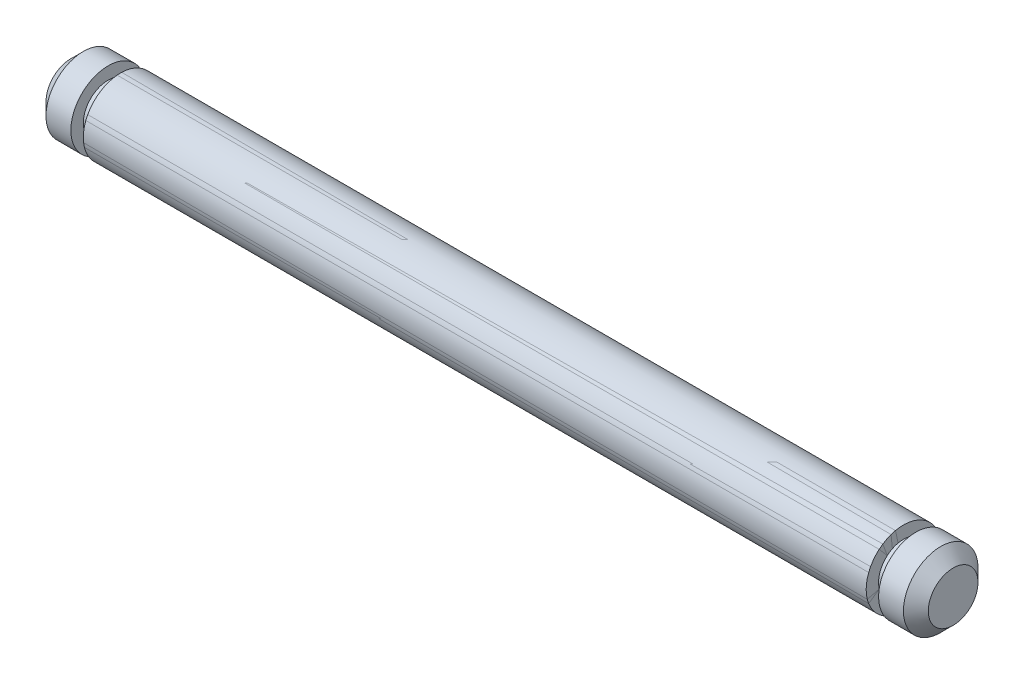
ISO-10303-21;
HEADER;
FILE_DESCRIPTION(('STEP AP214'),'2;1');
FILE_NAME('part.step','',(''),(''),'','','');
FILE_SCHEMA(('AUTOMOTIVE_DESIGN { 1 0 10303 214 1 1 1 1 }'));
ENDSEC;
DATA;
#1=APPLICATION_CONTEXT('core data for automotive mechanical design processes');
#2=APPLICATION_PROTOCOL_DEFINITION('international standard','automotive_design',2000,#1);
#3=PRODUCT_CONTEXT('',#1,'mechanical');
#4=PRODUCT('Part','Part','',(#3));
#5=PRODUCT_RELATED_PRODUCT_CATEGORY('part','',(#4));
#6=PRODUCT_DEFINITION_FORMATION('','',#4);
#7=PRODUCT_DEFINITION_CONTEXT('part definition',#1,'design');
#8=PRODUCT_DEFINITION('design','',#6,#7);
#9=PRODUCT_DEFINITION_SHAPE('','',#8);
#10=(LENGTH_UNIT() NAMED_UNIT(*) SI_UNIT(.MILLI.,.METRE.));
#11=(NAMED_UNIT(*) PLANE_ANGLE_UNIT() SI_UNIT($,.RADIAN.));
#12=(NAMED_UNIT(*) SI_UNIT($,.STERADIAN.) SOLID_ANGLE_UNIT());
#13=UNCERTAINTY_MEASURE_WITH_UNIT(LENGTH_MEASURE(1.E-05),#10,'distance_accuracy_value','');
#14=(GEOMETRIC_REPRESENTATION_CONTEXT(3) GLOBAL_UNCERTAINTY_ASSIGNED_CONTEXT((#13)) GLOBAL_UNIT_ASSIGNED_CONTEXT((#10,
#11,#12)) REPRESENTATION_CONTEXT('',''));
#15=CARTESIAN_POINT('',(0.,0.,0.));
#16=DIRECTION('',(0.,0.,1.));
#17=DIRECTION('',(1.,0.,0.));
#18=AXIS2_PLACEMENT_3D('',#15,#16,#17);
#19=CARTESIAN_POINT('',(-57.75,-1.3968022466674,0.22123174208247));
#20=DIRECTION('',(-1.,0.,0.));
#21=DIRECTION('',(0.,0.809016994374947,0.587785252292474));
#22=AXIS2_PLACEMENT_3D('',#19,#20,#21);
#23=PLANE('',#22);
#24=CARTESIAN_POINT('',(-57.75,0.,0.));
#25=DIRECTION('',(1.,0.,0.));
#26=DIRECTION('',(0.,0.,-1.));
#27=AXIS2_PLACEMENT_3D('',#24,#25,#26);
#28=CIRCLE('',#27,0.999999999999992);
#29=CARTESIAN_POINT('',(-57.75,0.,-0.999999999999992));
#30=VERTEX_POINT('',#29);
#31=EDGE_CURVE('P0_E406',#30,#30,#28,.F.);
#32=ORIENTED_EDGE('',*,*,#31,.T.);
#33=EDGE_LOOP('',(#32));
#34=FACE_BOUND('',#33,.T.);
#35=ADVANCED_FACE('P0_F348',(#34),#23,.T.);
#36=CARTESIAN_POINT('',(-57.25,0.,0.));
#37=DIRECTION('',(1.,0.,0.));
#38=DIRECTION('',(0.,0.,-1.));
#39=AXIS2_PLACEMENT_3D('',#36,#37,#38);
#40=CONICAL_SURFACE('',#39,1.49999999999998,0.785398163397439);
#41=ORIENTED_EDGE('',*,*,#31,.F.);
#42=EDGE_LOOP('',(#41));
#43=FACE_BOUND('',#42,.T.);
#44=CARTESIAN_POINT('',(-57.25,0.,0.));
#45=DIRECTION('',(-1.,0.,0.));
#46=DIRECTION('',(0.,0.809016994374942,0.58778525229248));
#47=AXIS2_PLACEMENT_3D('',#44,#45,#46);
#48=CIRCLE('',#47,1.49999999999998);
#49=CARTESIAN_POINT('',(-57.25,1.2135254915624,0.88167787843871));
#50=VERTEX_POINT('',#49);
#51=EDGE_CURVE('P0_E404',#50,#50,#48,.T.);
#52=ORIENTED_EDGE('',*,*,#51,.T.);
#53=EDGE_LOOP('',(#52));
#54=FACE_BOUND('',#53,.T.);
#55=ADVANCED_FACE('P0_F442',(#43,#54),#40,.T.);
#56=CARTESIAN_POINT('',(-56.25,0.,0.));
#57=DIRECTION('',(-1.,0.,0.));
#58=DIRECTION('',(0.,0.,1.));
#59=AXIS2_PLACEMENT_3D('',#56,#57,#58);
#60=CYLINDRICAL_SURFACE('',#59,1.49999999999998);
#61=ORIENTED_EDGE('',*,*,#51,.F.);
#62=EDGE_LOOP('',(#61));
#63=FACE_BOUND('',#62,.T.);
#64=CARTESIAN_POINT('',(-56.25,0.,0.));
#65=DIRECTION('',(-1.,0.,0.));
#66=DIRECTION('',(0.,0.,1.));
#67=AXIS2_PLACEMENT_3D('',#64,#65,#66);
#68=CIRCLE('',#67,1.49999999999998);
#69=CARTESIAN_POINT('',(-56.25,0.,1.49999999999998));
#70=VERTEX_POINT('',#69);
#71=EDGE_CURVE('P0_E399',#70,#70,#68,.F.);
#72=ORIENTED_EDGE('',*,*,#71,.F.);
#73=EDGE_LOOP('',(#72));
#74=FACE_BOUND('',#73,.T.);
#75=ADVANCED_FACE('P0_F447',(#63,#74),#60,.T.);
#76=CARTESIAN_POINT('',(-56.25,-0.33184761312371,-2.0952033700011));
#77=DIRECTION('',(1.,0.,0.));
#78=DIRECTION('',(0.,0.809016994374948,0.587785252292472));
#79=AXIS2_PLACEMENT_3D('',#76,#77,#78);
#80=PLANE('',#79);
#81=CARTESIAN_POINT('',(-56.25,0.,0.));
#82=DIRECTION('',(-1.,0.,0.));
#83=DIRECTION('',(0.,0.,1.));
#84=AXIS2_PLACEMENT_3D('',#81,#82,#83);
#85=CIRCLE('',#84,0.999999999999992);
#86=CARTESIAN_POINT('',(-56.25,0.,0.999999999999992));
#87=VERTEX_POINT('',#86);
#88=EDGE_CURVE('P0_E394',#87,#87,#85,.T.);
#89=ORIENTED_EDGE('',*,*,#88,.T.);
#90=EDGE_LOOP('',(#89));
#91=FACE_BOUND('',#90,.T.);
#92=ORIENTED_EDGE('',*,*,#71,.T.);
#93=EDGE_LOOP('',(#92));
#94=FACE_BOUND('',#93,.T.);
#95=ADVANCED_FACE('P0_F443',(#91,#94),#80,.T.);
#96=CARTESIAN_POINT('',(-55.75,0.,0.));
#97=DIRECTION('',(-1.,0.,0.));
#98=DIRECTION('',(0.,0.,1.));
#99=AXIS2_PLACEMENT_3D('',#96,#97,#98);
#100=CYLINDRICAL_SURFACE('',#99,0.999999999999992);
#101=ORIENTED_EDGE('',*,*,#88,.F.);
#102=EDGE_LOOP('',(#101));
#103=FACE_BOUND('',#102,.T.);
#104=CARTESIAN_POINT('',(-55.75,0.,0.));
#105=DIRECTION('',(-1.,0.,0.));
#106=DIRECTION('',(0.,0.,1.));
#107=AXIS2_PLACEMENT_3D('',#104,#105,#106);
#108=CIRCLE('',#107,0.999999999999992);
#109=CARTESIAN_POINT('',(-55.75,0.,0.999999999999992));
#110=VERTEX_POINT('',#109);
#111=EDGE_CURVE('P0_E389',#110,#110,#108,.F.);
#112=ORIENTED_EDGE('',*,*,#111,.F.);
#113=EDGE_LOOP('',(#112));
#114=FACE_BOUND('',#113,.T.);
#115=ADVANCED_FACE('P0_F446',(#103,#114),#100,.T.);
#116=CARTESIAN_POINT('',(-55.75,-2.0952033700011,0.33184761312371));
#117=DIRECTION('',(-1.,0.,0.));
#118=DIRECTION('',(0.,0.809016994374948,0.587785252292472));
#119=AXIS2_PLACEMENT_3D('',#116,#117,#118);
#120=PLANE('',#119);
#121=ORIENTED_EDGE('',*,*,#111,.T.);
#122=EDGE_LOOP('',(#121));
#123=FACE_BOUND('',#122,.T.);
#124=CARTESIAN_POINT('',(-55.75,0.,0.));
#125=DIRECTION('',(-1.,0.,0.));
#126=DIRECTION('',(0.,0.,1.));
#127=AXIS2_PLACEMENT_3D('',#124,#125,#126);
#128=CIRCLE('',#127,1.49999999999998);
#129=CARTESIAN_POINT('',(-55.75,0.,1.49999999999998));
#130=VERTEX_POINT('',#129);
#131=EDGE_CURVE('P0_E384',#130,#130,#128,.T.);
#132=ORIENTED_EDGE('',*,*,#131,.T.);
#133=EDGE_LOOP('',(#132));
#134=FACE_BOUND('',#133,.T.);
#135=ADVANCED_FACE('P0_F449',(#123,#134),#120,.T.);
#136=CARTESIAN_POINT('',(-22.25,-0.22123174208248,-1.3968022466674));
#137=DIRECTION('',(1.,0.,0.));
#138=DIRECTION('',(0.,0.809016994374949,0.587785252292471));
#139=AXIS2_PLACEMENT_3D('',#136,#137,#138);
#140=PLANE('',#139);
#141=CARTESIAN_POINT('',(-22.25,0.,0.));
#142=DIRECTION('',(-1.,0.,0.));
#143=DIRECTION('',(0.,0.,1.));
#144=AXIS2_PLACEMENT_3D('',#141,#142,#143);
#145=CIRCLE('',#144,0.999999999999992);
#146=CARTESIAN_POINT('',(-22.25,0.,0.999999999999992));
#147=VERTEX_POINT('',#146);
#148=EDGE_CURVE('P0_E379',#147,#147,#145,.F.);
#149=ORIENTED_EDGE('',*,*,#148,.T.);
#150=EDGE_LOOP('',(#149));
#151=FACE_BOUND('',#150,.T.);
#152=ADVANCED_FACE('P0_F452',(#151),#140,.T.);
#153=CARTESIAN_POINT('',(-24.25,0.,0.));
#154=DIRECTION('',(-1.,0.,0.));
#155=DIRECTION('',(0.,0.,1.));
#156=AXIS2_PLACEMENT_3D('',#153,#154,#155);
#157=CYLINDRICAL_SURFACE('',#156,1.49999999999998);
#158=ORIENTED_EDGE('',*,*,#131,.F.);
#159=EDGE_LOOP('',(#158));
#160=FACE_BOUND('',#159,.T.);
#161=CARTESIAN_POINT('',(-24.25,0.,0.));
#162=DIRECTION('',(-1.,0.,0.));
#163=DIRECTION('',(0.,0.,1.));
#164=AXIS2_PLACEMENT_3D('',#161,#162,#163);
#165=CIRCLE('',#164,1.49999999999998);
#166=CARTESIAN_POINT('',(-24.25,0.,1.49999999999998));
#167=VERTEX_POINT('',#166);
#168=EDGE_CURVE('P0_E376',#167,#167,#165,.F.);
#169=ORIENTED_EDGE('',*,*,#168,.F.);
#170=EDGE_LOOP('',(#169));
#171=FACE_BOUND('',#170,.T.);
#172=ADVANCED_FACE('P0_F455',(#160,#171),#157,.T.);
#173=CARTESIAN_POINT('',(-22.25,0.,0.));
#174=DIRECTION('',(-1.,0.,0.));
#175=DIRECTION('',(0.,0.,1.));
#176=AXIS2_PLACEMENT_3D('',#173,#174,#175);
#177=CONICAL_SURFACE('',#176,0.999999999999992,0.785398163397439);
#178=ORIENTED_EDGE('',*,*,#148,.F.);
#179=EDGE_LOOP('',(#178));
#180=FACE_BOUND('',#179,.T.);
#181=CARTESIAN_POINT('',(-22.75,0.,0.));
#182=DIRECTION('',(-1.,0.,0.));
#183=DIRECTION('',(0.,0.809016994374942,0.58778525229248));
#184=AXIS2_PLACEMENT_3D('',#181,#182,#183);
#185=CIRCLE('',#184,1.49999999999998);
#186=CARTESIAN_POINT('',(-22.75,1.2135254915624,0.88167787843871));
#187=VERTEX_POINT('',#186);
#188=EDGE_CURVE('P0_E373',#187,#187,#185,.F.);
#189=ORIENTED_EDGE('',*,*,#188,.T.);
#190=EDGE_LOOP('',(#189));
#191=FACE_BOUND('',#190,.T.);
#192=ADVANCED_FACE('P0_F419',(#180,#191),#177,.T.);
#193=CARTESIAN_POINT('',(-24.25,-0.33184761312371,-2.0952033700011));
#194=DIRECTION('',(1.,0.,0.));
#195=DIRECTION('',(0.,0.809016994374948,0.587785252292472));
#196=AXIS2_PLACEMENT_3D('',#193,#194,#195);
#197=PLANE('',#196);
#198=CARTESIAN_POINT('',(-24.25,0.,0.));
#199=DIRECTION('',(-1.,0.,0.));
#200=DIRECTION('',(0.,0.,1.));
#201=AXIS2_PLACEMENT_3D('',#198,#199,#200);
#202=CIRCLE('',#201,0.999999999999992);
#203=CARTESIAN_POINT('',(-24.25,0.,0.999999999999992));
#204=VERTEX_POINT('',#203);
#205=EDGE_CURVE('P0_E361',#204,#204,#202,.T.);
#206=ORIENTED_EDGE('',*,*,#205,.T.);
#207=EDGE_LOOP('',(#206));
#208=FACE_BOUND('',#207,.T.);
#209=ORIENTED_EDGE('',*,*,#168,.T.);
#210=EDGE_LOOP('',(#209));
#211=FACE_BOUND('',#210,.T.);
#212=ADVANCED_FACE('P0_F425',(#208,#211),#197,.T.);
#213=CARTESIAN_POINT('',(-22.75,0.,0.));
#214=DIRECTION('',(-1.,0.,0.));
#215=DIRECTION('',(0.,0.,1.));
#216=AXIS2_PLACEMENT_3D('',#213,#214,#215);
#217=CYLINDRICAL_SURFACE('',#216,1.49999999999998);
#218=ORIENTED_EDGE('',*,*,#188,.F.);
#219=EDGE_LOOP('',(#218));
#220=FACE_BOUND('',#219,.T.);
#221=CARTESIAN_POINT('',(-23.75,0.,0.));
#222=DIRECTION('',(-1.,0.,0.));
#223=DIRECTION('',(0.,0.,1.));
#224=AXIS2_PLACEMENT_3D('',#221,#222,#223);
#225=CIRCLE('',#224,1.49999999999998);
#226=CARTESIAN_POINT('',(-23.75,0.,1.49999999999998));
#227=VERTEX_POINT('',#226);
#228=EDGE_CURVE('P0_E356',#227,#227,#225,.T.);
#229=ORIENTED_EDGE('',*,*,#228,.F.);
#230=EDGE_LOOP('',(#229));
#231=FACE_BOUND('',#230,.T.);
#232=ADVANCED_FACE('P0_F421',(#220,#231),#217,.T.);
#233=CARTESIAN_POINT('',(-23.75,0.,0.));
#234=DIRECTION('',(-1.,0.,0.));
#235=DIRECTION('',(0.,0.,1.));
#236=AXIS2_PLACEMENT_3D('',#233,#234,#235);
#237=CYLINDRICAL_SURFACE('',#236,0.999999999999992);
#238=CARTESIAN_POINT('',(-23.75,0.,0.));
#239=DIRECTION('',(-1.,0.,0.));
#240=DIRECTION('',(0.,0.,1.));
#241=AXIS2_PLACEMENT_3D('',#238,#239,#240);
#242=CIRCLE('',#241,0.999999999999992);
#243=CARTESIAN_POINT('',(-23.75,0.,0.999999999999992));
#244=VERTEX_POINT('',#243);
#245=EDGE_CURVE('P0_E10',#244,#244,#242,.F.);
#246=ORIENTED_EDGE('',*,*,#245,.F.);
#247=EDGE_LOOP('',(#246));
#248=FACE_BOUND('',#247,.T.);
#249=ORIENTED_EDGE('',*,*,#205,.F.);
#250=EDGE_LOOP('',(#249));
#251=FACE_BOUND('',#250,.T.);
#252=ADVANCED_FACE('P0_F424',(#248,#251),#237,.T.);
#253=CARTESIAN_POINT('',(-23.75,-2.0952033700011,0.33184761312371));
#254=DIRECTION('',(-1.,0.,0.));
#255=DIRECTION('',(0.,0.809016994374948,0.587785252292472));
#256=AXIS2_PLACEMENT_3D('',#253,#254,#255);
#257=PLANE('',#256);
#258=ORIENTED_EDGE('',*,*,#245,.T.);
#259=EDGE_LOOP('',(#258));
#260=FACE_BOUND('',#259,.T.);
#261=ORIENTED_EDGE('',*,*,#228,.T.);
#262=EDGE_LOOP('',(#261));
#263=FACE_BOUND('',#262,.T.);
#264=ADVANCED_FACE('P0_F350',(#260,#263),#257,.T.);
#265=CLOSED_SHELL('',(#35,#55,#75,#95,#115,#135,#152,#172,#192,#212,#232,#252,#264));
#266=MANIFOLD_SOLID_BREP('P0_B2',#265);
#267=CARTESIAN_POINT('',(-57.75,-1.3968022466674,0.22123174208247));
#268=DIRECTION('',(-1.,0.,0.));
#269=DIRECTION('',(0.,0.809016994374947,0.587785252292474));
#270=AXIS2_PLACEMENT_3D('',#267,#268,#269);
#271=PLANE('',#270);
#272=CARTESIAN_POINT('',(-57.75,0.,0.));
#273=DIRECTION('',(1.,0.,0.));
#274=DIRECTION('',(0.,0.,-1.));
#275=AXIS2_PLACEMENT_3D('',#272,#273,#274);
#276=CIRCLE('',#275,0.999999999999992);
#277=CARTESIAN_POINT('',(-57.75,0.,-0.999999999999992));
#278=VERTEX_POINT('',#277);
#279=EDGE_CURVE('P1_E72',#278,#278,#276,.F.);
#280=ORIENTED_EDGE('',*,*,#279,.T.);
#281=EDGE_LOOP('',(#280));
#282=FACE_BOUND('',#281,.T.);
#283=ADVANCED_FACE('P1_F14',(#282),#271,.T.);
#284=CARTESIAN_POINT('',(-57.25,0.,0.));
#285=DIRECTION('',(1.,0.,0.));
#286=DIRECTION('',(0.,0.,-1.));
#287=AXIS2_PLACEMENT_3D('',#284,#285,#286);
#288=CONICAL_SURFACE('',#287,1.49999999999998,0.785398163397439);
#289=ORIENTED_EDGE('',*,*,#279,.F.);
#290=EDGE_LOOP('',(#289));
#291=FACE_BOUND('',#290,.T.);
#292=CARTESIAN_POINT('',(-57.25,0.,0.));
#293=DIRECTION('',(-1.,0.,0.));
#294=DIRECTION('',(0.,0.809016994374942,0.58778525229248));
#295=AXIS2_PLACEMENT_3D('',#292,#293,#294);
#296=CIRCLE('',#295,1.49999999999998);
#297=CARTESIAN_POINT('',(-57.25,1.2135254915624,0.88167787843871));
#298=VERTEX_POINT('',#297);
#299=EDGE_CURVE('P1_E70',#298,#298,#296,.T.);
#300=ORIENTED_EDGE('',*,*,#299,.T.);
#301=EDGE_LOOP('',(#300));
#302=FACE_BOUND('',#301,.T.);
#303=ADVANCED_FACE('P1_F100',(#291,#302),#288,.T.);
#304=CARTESIAN_POINT('',(-56.25,0.,0.));
#305=DIRECTION('',(-1.,0.,0.));
#306=DIRECTION('',(0.,0.,1.));
#307=AXIS2_PLACEMENT_3D('',#304,#305,#306);
#308=CYLINDRICAL_SURFACE('',#307,1.49999999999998);
#309=ORIENTED_EDGE('',*,*,#299,.F.);
#310=EDGE_LOOP('',(#309));
#311=FACE_BOUND('',#310,.T.);
#312=CARTESIAN_POINT('',(-56.25,0.,0.));
#313=DIRECTION('',(-1.,0.,0.));
#314=DIRECTION('',(0.,0.,1.));
#315=AXIS2_PLACEMENT_3D('',#312,#313,#314);
#316=CIRCLE('',#315,1.49999999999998);
#317=CARTESIAN_POINT('',(-56.25,0.,1.49999999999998));
#318=VERTEX_POINT('',#317);
#319=EDGE_CURVE('P1_E65',#318,#318,#316,.F.);
#320=ORIENTED_EDGE('',*,*,#319,.F.);
#321=EDGE_LOOP('',(#320));
#322=FACE_BOUND('',#321,.T.);
#323=ADVANCED_FACE('P1_F104',(#311,#322),#308,.T.);
#324=CARTESIAN_POINT('',(-56.25,-0.33184761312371,-2.0952033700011));
#325=DIRECTION('',(1.,0.,0.));
#326=DIRECTION('',(0.,0.809016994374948,0.587785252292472));
#327=AXIS2_PLACEMENT_3D('',#324,#325,#326);
#328=PLANE('',#327);
#329=CARTESIAN_POINT('',(-56.25,0.,0.));
#330=DIRECTION('',(-1.,0.,0.));
#331=DIRECTION('',(0.,0.,1.));
#332=AXIS2_PLACEMENT_3D('',#329,#330,#331);
#333=CIRCLE('',#332,0.999999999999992);
#334=CARTESIAN_POINT('',(-56.25,0.,0.999999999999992));
#335=VERTEX_POINT('',#334);
#336=EDGE_CURVE('P1_E60',#335,#335,#333,.T.);
#337=ORIENTED_EDGE('',*,*,#336,.T.);
#338=EDGE_LOOP('',(#337));
#339=FACE_BOUND('',#338,.T.);
#340=ORIENTED_EDGE('',*,*,#319,.T.);
#341=EDGE_LOOP('',(#340));
#342=FACE_BOUND('',#341,.T.);
#343=ADVANCED_FACE('P1_F101',(#339,#342),#328,.T.);
#344=CARTESIAN_POINT('',(-55.75,0.,0.));
#345=DIRECTION('',(-1.,0.,0.));
#346=DIRECTION('',(0.,0.,1.));
#347=AXIS2_PLACEMENT_3D('',#344,#345,#346);
#348=CYLINDRICAL_SURFACE('',#347,0.999999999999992);
#349=ORIENTED_EDGE('',*,*,#336,.F.);
#350=EDGE_LOOP('',(#349));
#351=FACE_BOUND('',#350,.T.);
#352=CARTESIAN_POINT('',(-55.75,0.,0.));
#353=DIRECTION('',(-1.,0.,0.));
#354=DIRECTION('',(0.,0.,1.));
#355=AXIS2_PLACEMENT_3D('',#352,#353,#354);
#356=CIRCLE('',#355,0.999999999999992);
#357=CARTESIAN_POINT('',(-55.75,0.,0.999999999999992));
#358=VERTEX_POINT('',#357);
#359=EDGE_CURVE('P1_E55',#358,#358,#356,.F.);
#360=ORIENTED_EDGE('',*,*,#359,.F.);
#361=EDGE_LOOP('',(#360));
#362=FACE_BOUND('',#361,.T.);
#363=ADVANCED_FACE('P1_F103',(#351,#362),#348,.T.);
#364=CARTESIAN_POINT('',(-55.75,-2.0952033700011,0.33184761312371));
#365=DIRECTION('',(-1.,0.,0.));
#366=DIRECTION('',(0.,0.809016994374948,0.587785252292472));
#367=AXIS2_PLACEMENT_3D('',#364,#365,#366);
#368=PLANE('',#367);
#369=ORIENTED_EDGE('',*,*,#359,.T.);
#370=EDGE_LOOP('',(#369));
#371=FACE_BOUND('',#370,.T.);
#372=CARTESIAN_POINT('',(-55.75,0.,0.));
#373=DIRECTION('',(-1.,0.,0.));
#374=DIRECTION('',(0.,0.,1.));
#375=AXIS2_PLACEMENT_3D('',#372,#373,#374);
#376=CIRCLE('',#375,1.49999999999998);
#377=CARTESIAN_POINT('',(-55.75,0.,1.49999999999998));
#378=VERTEX_POINT('',#377);
#379=EDGE_CURVE('P1_E50',#378,#378,#376,.T.);
#380=ORIENTED_EDGE('',*,*,#379,.T.);
#381=EDGE_LOOP('',(#380));
#382=FACE_BOUND('',#381,.T.);
#383=ADVANCED_FACE('P1_F106',(#371,#382),#368,.T.);
#384=CARTESIAN_POINT('',(-22.25,-0.22123174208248,-1.3968022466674));
#385=DIRECTION('',(1.,0.,0.));
#386=DIRECTION('',(0.,0.809016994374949,0.587785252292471));
#387=AXIS2_PLACEMENT_3D('',#384,#385,#386);
#388=PLANE('',#387);
#389=CARTESIAN_POINT('',(-22.25,0.,0.));
#390=DIRECTION('',(-1.,0.,0.));
#391=DIRECTION('',(0.,0.,1.));
#392=AXIS2_PLACEMENT_3D('',#389,#390,#391);
#393=CIRCLE('',#392,0.999999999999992);
#394=CARTESIAN_POINT('',(-22.25,0.,0.999999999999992));
#395=VERTEX_POINT('',#394);
#396=EDGE_CURVE('P1_E45',#395,#395,#393,.F.);
#397=ORIENTED_EDGE('',*,*,#396,.T.);
#398=EDGE_LOOP('',(#397));
#399=FACE_BOUND('',#398,.T.);
#400=ADVANCED_FACE('P1_F108',(#399),#388,.T.);
#401=CARTESIAN_POINT('',(-24.25,0.,0.));
#402=DIRECTION('',(-1.,0.,0.));
#403=DIRECTION('',(0.,0.,1.));
#404=AXIS2_PLACEMENT_3D('',#401,#402,#403);
#405=CYLINDRICAL_SURFACE('',#404,1.49999999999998);
#406=ORIENTED_EDGE('',*,*,#379,.F.);
#407=EDGE_LOOP('',(#406));
#408=FACE_BOUND('',#407,.T.);
#409=CARTESIAN_POINT('',(-24.25,0.,0.));
#410=DIRECTION('',(-1.,0.,0.));
#411=DIRECTION('',(0.,0.,1.));
#412=AXIS2_PLACEMENT_3D('',#409,#410,#411);
#413=CIRCLE('',#412,1.49999999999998);
#414=CARTESIAN_POINT('',(-24.25,0.,1.49999999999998));
#415=VERTEX_POINT('',#414);
#416=EDGE_CURVE('P1_E42',#415,#415,#413,.F.);
#417=ORIENTED_EDGE('',*,*,#416,.F.);
#418=EDGE_LOOP('',(#417));
#419=FACE_BOUND('',#418,.T.);
#420=ADVANCED_FACE('P1_F110',(#408,#419),#405,.T.);
#421=CARTESIAN_POINT('',(-22.25,0.,0.));
#422=DIRECTION('',(-1.,0.,0.));
#423=DIRECTION('',(0.,0.,1.));
#424=AXIS2_PLACEMENT_3D('',#421,#422,#423);
#425=CONICAL_SURFACE('',#424,0.999999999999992,0.785398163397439);
#426=ORIENTED_EDGE('',*,*,#396,.F.);
#427=EDGE_LOOP('',(#426));
#428=FACE_BOUND('',#427,.T.);
#429=CARTESIAN_POINT('',(-22.75,0.,0.));
#430=DIRECTION('',(-1.,0.,0.));
#431=DIRECTION('',(0.,0.809016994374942,0.58778525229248));
#432=AXIS2_PLACEMENT_3D('',#429,#430,#431);
#433=CIRCLE('',#432,1.49999999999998);
#434=CARTESIAN_POINT('',(-22.75,1.2135254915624,0.88167787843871));
#435=VERTEX_POINT('',#434);
#436=EDGE_CURVE('P1_E39',#435,#435,#433,.F.);
#437=ORIENTED_EDGE('',*,*,#436,.T.);
#438=EDGE_LOOP('',(#437));
#439=FACE_BOUND('',#438,.T.);
#440=ADVANCED_FACE('P1_F85',(#428,#439),#425,.T.);
#441=CARTESIAN_POINT('',(-24.25,-0.33184761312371,-2.0952033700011));
#442=DIRECTION('',(1.,0.,0.));
#443=DIRECTION('',(0.,0.809016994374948,0.587785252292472));
#444=AXIS2_PLACEMENT_3D('',#441,#442,#443);
#445=PLANE('',#444);
#446=CARTESIAN_POINT('',(-24.25,0.,0.));
#447=DIRECTION('',(-1.,0.,0.));
#448=DIRECTION('',(0.,0.,1.));
#449=AXIS2_PLACEMENT_3D('',#446,#447,#448);
#450=CIRCLE('',#449,0.999999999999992);
#451=CARTESIAN_POINT('',(-24.25,0.,0.999999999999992));
#452=VERTEX_POINT('',#451);
#453=EDGE_CURVE('P1_E27',#452,#452,#450,.T.);
#454=ORIENTED_EDGE('',*,*,#453,.T.);
#455=EDGE_LOOP('',(#454));
#456=FACE_BOUND('',#455,.T.);
#457=ORIENTED_EDGE('',*,*,#416,.T.);
#458=EDGE_LOOP('',(#457));
#459=FACE_BOUND('',#458,.T.);
#460=ADVANCED_FACE('P1_F90',(#456,#459),#445,.T.);
#461=CARTESIAN_POINT('',(-22.75,0.,0.));
#462=DIRECTION('',(-1.,0.,0.));
#463=DIRECTION('',(0.,0.,1.));
#464=AXIS2_PLACEMENT_3D('',#461,#462,#463);
#465=CYLINDRICAL_SURFACE('',#464,1.49999999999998);
#466=ORIENTED_EDGE('',*,*,#436,.F.);
#467=EDGE_LOOP('',(#466));
#468=FACE_BOUND('',#467,.T.);
#469=CARTESIAN_POINT('',(-23.75,0.,0.));
#470=DIRECTION('',(-1.,0.,0.));
#471=DIRECTION('',(0.,0.,1.));
#472=AXIS2_PLACEMENT_3D('',#469,#470,#471);
#473=CIRCLE('',#472,1.49999999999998);
#474=CARTESIAN_POINT('',(-23.75,0.,1.49999999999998));
#475=VERTEX_POINT('',#474);
#476=EDGE_CURVE('P1_E22',#475,#475,#473,.T.);
#477=ORIENTED_EDGE('',*,*,#476,.F.);
#478=EDGE_LOOP('',(#477));
#479=FACE_BOUND('',#478,.T.);
#480=ADVANCED_FACE('P1_F87',(#468,#479),#465,.T.);
#481=CARTESIAN_POINT('',(-23.75,0.,0.));
#482=DIRECTION('',(-1.,0.,0.));
#483=DIRECTION('',(0.,0.,1.));
#484=AXIS2_PLACEMENT_3D('',#481,#482,#483);
#485=CYLINDRICAL_SURFACE('',#484,0.999999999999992);
#486=CARTESIAN_POINT('',(-23.75,0.,0.));
#487=DIRECTION('',(-1.,0.,0.));
#488=DIRECTION('',(0.,0.,1.));
#489=AXIS2_PLACEMENT_3D('',#486,#487,#488);
#490=CIRCLE('',#489,0.999999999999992);
#491=CARTESIAN_POINT('',(-23.75,0.,0.999999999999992));
#492=VERTEX_POINT('',#491);
#493=EDGE_CURVE('P1_E9',#492,#492,#490,.F.);
#494=ORIENTED_EDGE('',*,*,#493,.F.);
#495=EDGE_LOOP('',(#494));
#496=FACE_BOUND('',#495,.T.);
#497=ORIENTED_EDGE('',*,*,#453,.F.);
#498=EDGE_LOOP('',(#497));
#499=FACE_BOUND('',#498,.T.);
#500=ADVANCED_FACE('P1_F89',(#496,#499),#485,.T.);
#501=CARTESIAN_POINT('',(-23.75,-2.0952033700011,0.33184761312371));
#502=DIRECTION('',(-1.,0.,0.));
#503=DIRECTION('',(0.,0.809016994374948,0.587785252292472));
#504=AXIS2_PLACEMENT_3D('',#501,#502,#503);
#505=PLANE('',#504);
#506=ORIENTED_EDGE('',*,*,#493,.T.);
#507=EDGE_LOOP('',(#506));
#508=FACE_BOUND('',#507,.T.);
#509=ORIENTED_EDGE('',*,*,#476,.T.);
#510=EDGE_LOOP('',(#509));
#511=FACE_BOUND('',#510,.T.);
#512=ADVANCED_FACE('P1_F16',(#508,#511),#505,.T.);
#513=CLOSED_SHELL('',(#283,#303,#323,#343,#363,#383,#400,#420,#440,#460,#480,#500,#512));
#514=MANIFOLD_SOLID_BREP('P1_B1',#513);
#515=ADVANCED_BREP_SHAPE_REPRESENTATION('',(#18,#266,#514),#14);
#516=SHAPE_DEFINITION_REPRESENTATION(#9,#515);
ENDSEC;
END-ISO-10303-21;
